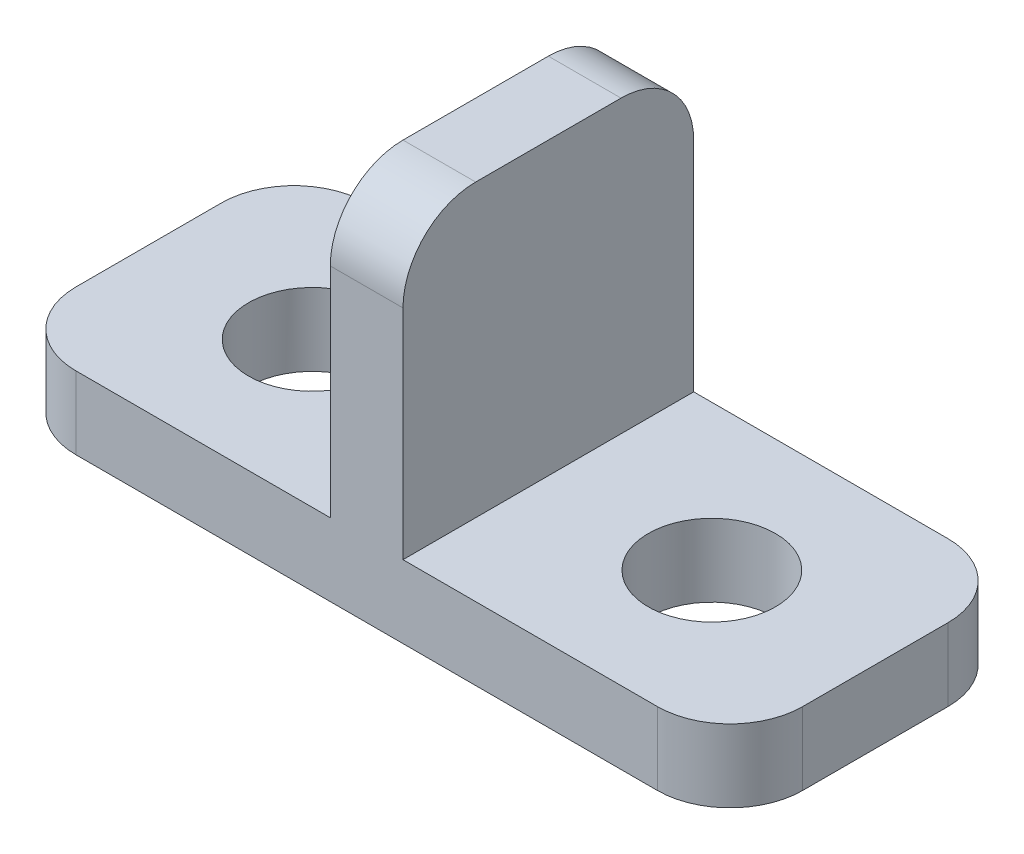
from build123d import *

# Parameters (mm, degrees)
SKETCH_1_W          = 20
SKETCH_1_H          = 8
EXTRUDE_1_DEPTH     = 2
SKETCH_2_W          = 2
SKETCH_2_H          = 8
EXTRUDE_2_DEPTH     = 8
SKETCH_3_R          = 1.75
CUT_EXTRUDE_1_DEPTH = 10
FILLET_1_R          = 2


with BuildPart() as part:
    # Sketch 1 → Extrude 1 (new body)
    with BuildSketch(Plane(origin=(0, 0, 0), x_dir=(1, 0, 0), z_dir=(0, 1, 0))):
        Rectangle(SKETCH_1_W, SKETCH_1_H)
    extrude(amount=EXTRUDE_1_DEPTH)

    # Sketch 2 → Extrude 2 (add)
    with BuildSketch(Plane(origin=(0, 2, 0), x_dir=(1, 0, 0), z_dir=(0, 1, 0))):
        Rectangle(SKETCH_2_W, SKETCH_2_H)
    extrude(amount=EXTRUDE_2_DEPTH)

    # Sketch 3 → Cut-Extrude 1 (cut)
    with BuildSketch(Plane(origin=(0, 2, 0), x_dir=(1, 0, 0), z_dir=(0, 1, 0))):
        with Locations(Location((-5.5, 0, 0), (0, 0, 270))):
            Circle(SKETCH_3_R)
        with Locations(Location((5.5, 0, 0), (0, 0, 90))):
            Circle(SKETCH_3_R)
    extrude(amount=-CUT_EXTRUDE_1_DEPTH, mode=Mode.SUBTRACT)

    # Fillet 1
    fillet_1_edges = [part.edges().sort_by_distance(p)[0] for p in [
        (0, 10, -4),
        (0, 10, 4),
        (10, 1, 4),
        (-10, 1, 4),
        (-10, 1, -4),
        (10, 1, -4),
    ]]
    fillet(fillet_1_edges, radius=FILLET_1_R)


solid = part.part
